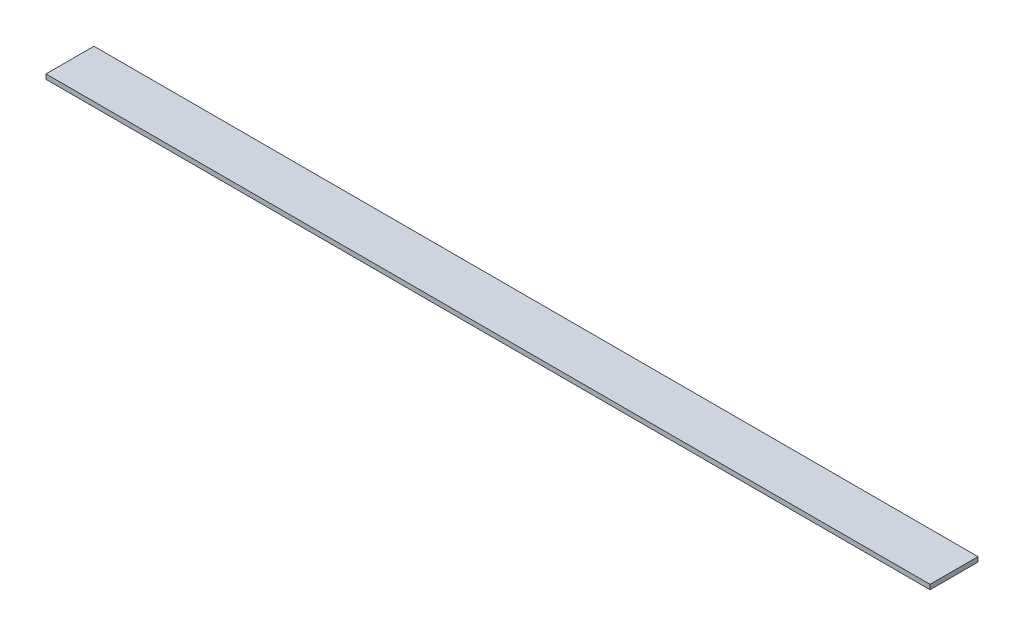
from build123d import *

# Parameters (mm, degrees)
SKETCH1_W           = 1873.25
SKETCH1_H           = 101.6
BOSS_EXTRUDE1_DEPTH = 10


with BuildPart() as part:
    # Sketch1 → Boss-Extrude1 (new body)
    with BuildSketch(Plane(origin=(0, 10, 0), x_dir=(-1, 0, 0), z_dir=(0, 1, 0))):
        Rectangle(SKETCH1_W, SKETCH1_H)
    extrude(amount=-BOSS_EXTRUDE1_DEPTH)


solid = part.part
